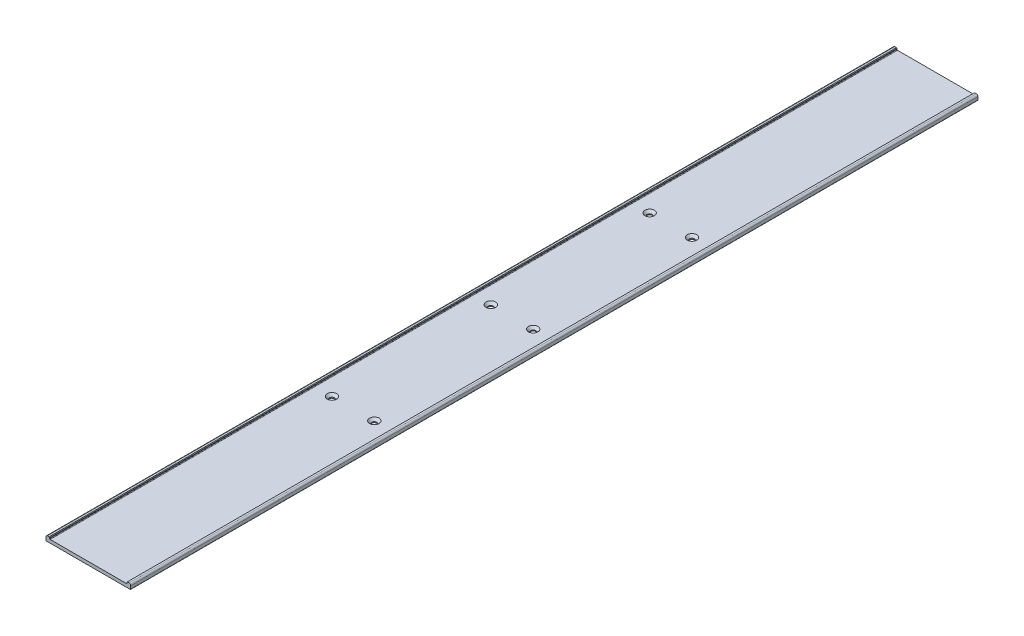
from build123d import *

# Parameters (mm, degrees)
BOSS_EXTRUDE1_DEPTH = 400
LPATTERN1_COUNT     = 2
LPATTERN1_PITCH     = 150
LPATTERN1_COL_COUNT = 2
LPATTERN1_COL_PITCH = 150
LPATTERN2_COUNT     = 2
LPATTERN2_PITCH     = 40


with BuildPart() as part:
    # Sketch1 → Boss-Extrude1 (new, symmetric)
    with BuildSketch(Plane.XY):
        with BuildLine():
            Line((76.75, 4.8), (78.5, 4.8))
            ThreePointArc((78.5, 4.8), (79.560660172, 4.360660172), (80, 3.3))
            Line((80, 3.3), (80, 0.5))
            ThreePointArc((80, 0.5), (79.853553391, 0.146446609), (79.5, 0))
            Line((79.5, 0), (0.5, 0))
            ThreePointArc((0.5, 0), (0.146446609, 0.146446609), (0, 0.5))
            Line((0, 0.5), (0, 3.3))
            ThreePointArc((0, 3.3), (0.439339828, 4.360660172), (1.5, 4.8))
            Line((1.5, 4.8), (3, 4.8))
            Line((3, 4.8), (3.5, 4.3))
            Line((3.5, 4.3), (3.5, 3.6))
            ThreePointArc((3.5, 3.6), (3.646446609, 3.246446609), (4, 3.1))
            Line((4, 3.1), (76, 3.1))
            ThreePointArc((76, 3.1), (76.353553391, 3.246446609), (76.5, 3.6))
            Line((76.5, 3.6), (76.5, 4.55))
            Line((76.5, 4.55), (76.75, 4.8))
        make_face()
    extrude(amount=BOSS_EXTRUDE1_DEPTH, both=True)

    # Sketch4 → CSK for M4 Hex Socket Countersunk Cap Sc (revolve, cut)
    with BuildSketch(Plane(origin=(20, 3.1, 0), x_dir=(0, 0, 1), z_dir=(1, 0, 0))):
        Polygon((0, 0), (0, 39.351936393), (2.25, 38), (2.25, 2.23), (4.48, 0), align=None)
    csk_for_m4_hex_socket_countersunk_cap_sc = revolve(axis=Axis((20, 9.45, 0), (0, -1, 0)), mode=Mode.SUBTRACT)

    # LPattern1: CSK for M4 Hex Socket Countersunk Cap Sc ×2
    with Locations(*[(0, 0, -i * LPATTERN1_PITCH) for i in range(1, LPATTERN1_COUNT)]):
        add(csk_for_m4_hex_socket_countersunk_cap_sc, mode=Mode.SUBTRACT)

    # LPattern1 col: CSK for M4 Hex Socket Countersunk Cap Sc ×2
    with Locations(*[(0, 0, i * LPATTERN1_COL_PITCH) for i in range(1, LPATTERN1_COL_COUNT)]):
        add(csk_for_m4_hex_socket_countersunk_cap_sc, mode=Mode.SUBTRACT)

    # LPattern2: CSK for M4 Hex Socket Countersunk Cap Sc ×2
    with Locations(*[(i * LPATTERN2_PITCH, 0, 0) for i in range(1, LPATTERN2_COUNT)]):
        add(csk_for_m4_hex_socket_countersunk_cap_sc, mode=Mode.SUBTRACT)

    # LPattern2 copy 1 sketch → LPattern2 copy 1 (revolve, cut)
    with BuildSketch(Plane(origin=(60, 3.1, -150), x_dir=(0, 0, 1), z_dir=(1, 0, 0))):
        Polygon((0, 0), (0, 39.351936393), (2.25, 38), (2.25, 2.23), (4.48, 0), align=None)
    revolve(axis=Axis((60, 9.45, -150), (0, -1, 0)), mode=Mode.SUBTRACT)

    # LPattern2 copy 2 sketch → LPattern2 copy 2 (revolve, cut)
    with BuildSketch(Plane(origin=(60, 3.1, 150), x_dir=(0, 0, 1), z_dir=(1, 0, 0))):
        Polygon((0, 0), (0, 39.351936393), (2.25, 38), (2.25, 2.23), (4.48, 0), align=None)
    revolve(axis=Axis((60, 9.45, 150), (0, -1, 0)), mode=Mode.SUBTRACT)


solid = part.part
